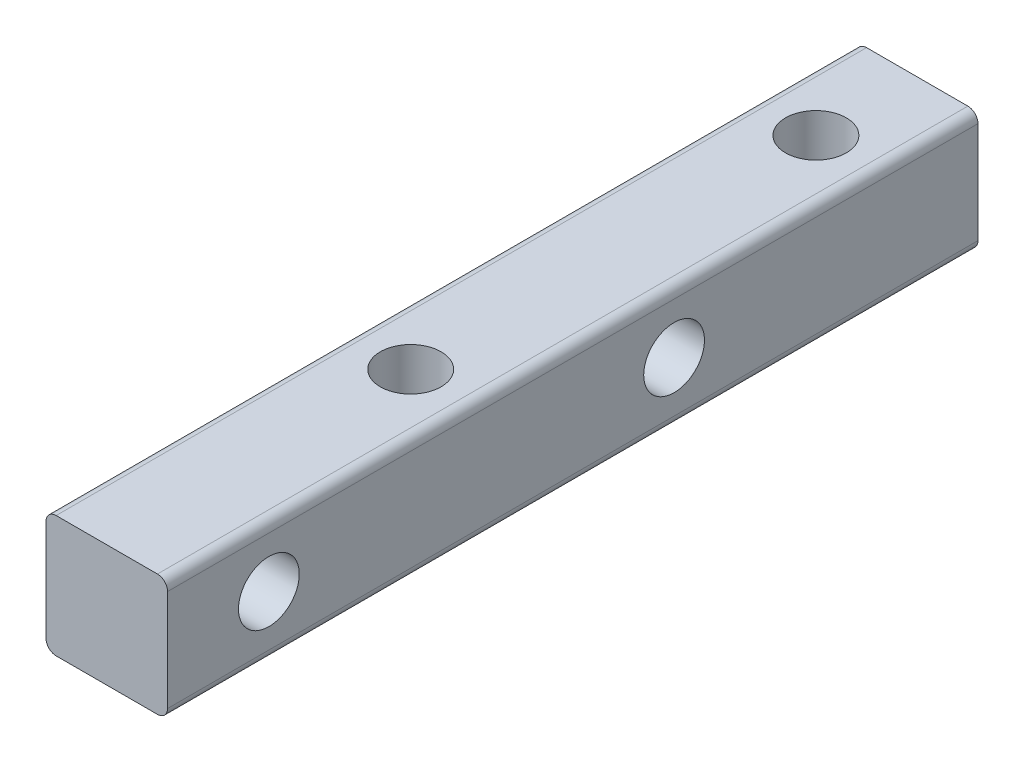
from build123d import *

# Parameters (mm, degrees)
SKETCH_1_W          = 6
SKETCH_1_H          = 6
EXTRUDE_1_DEPTH     = 40
SKETCH_2_R          = 1.5
CUT_EXTRUDE_1_DEPTH = 50
SKETCH_3_R          = 1.5
CUT_EXTRUDE_2_DEPTH = 50
FILLET_1_R          = 0.5


with BuildPart() as part:
    # Sketch 1 → Extrude 1 (new body)
    with BuildSketch(Plane.XY):
        with Locations((3, 3)):
            Rectangle(SKETCH_1_W, SKETCH_1_H)
    extrude(amount=EXTRUDE_1_DEPTH)

    # Sketch 2 → Cut-Extrude 1 (cut)
    with BuildSketch(Plane(origin=(0, 6, 0), x_dir=(1, 0, 0), z_dir=(0, 1, 0))):
        with Locations(Location((3, -5, 0), (0, 0, 270))):
            Circle(SKETCH_2_R)
        with Locations(Location((3, -25, 0), (0, 0, 270))):
            Circle(SKETCH_2_R)
    extrude(amount=-CUT_EXTRUDE_1_DEPTH, mode=Mode.SUBTRACT)

    # Sketch 3 → Cut-Extrude 2 (cut)
    with BuildSketch(Plane.ZY):
        with Locations((35, 3)):
            Circle(SKETCH_3_R)
        with Locations((15, 3)):
            Circle(SKETCH_3_R)
    extrude(amount=-CUT_EXTRUDE_2_DEPTH, mode=Mode.SUBTRACT)

    # Fillet 1
    fillet_1_edges = [part.edges().sort_by_distance(p)[0] for p in [
        (0, 6, 20),
        (6, 6, 20),
        (6, 0, 20),
        (0, 0, 20),
    ]]
    fillet(fillet_1_edges, radius=FILLET_1_R)


solid = part.part
